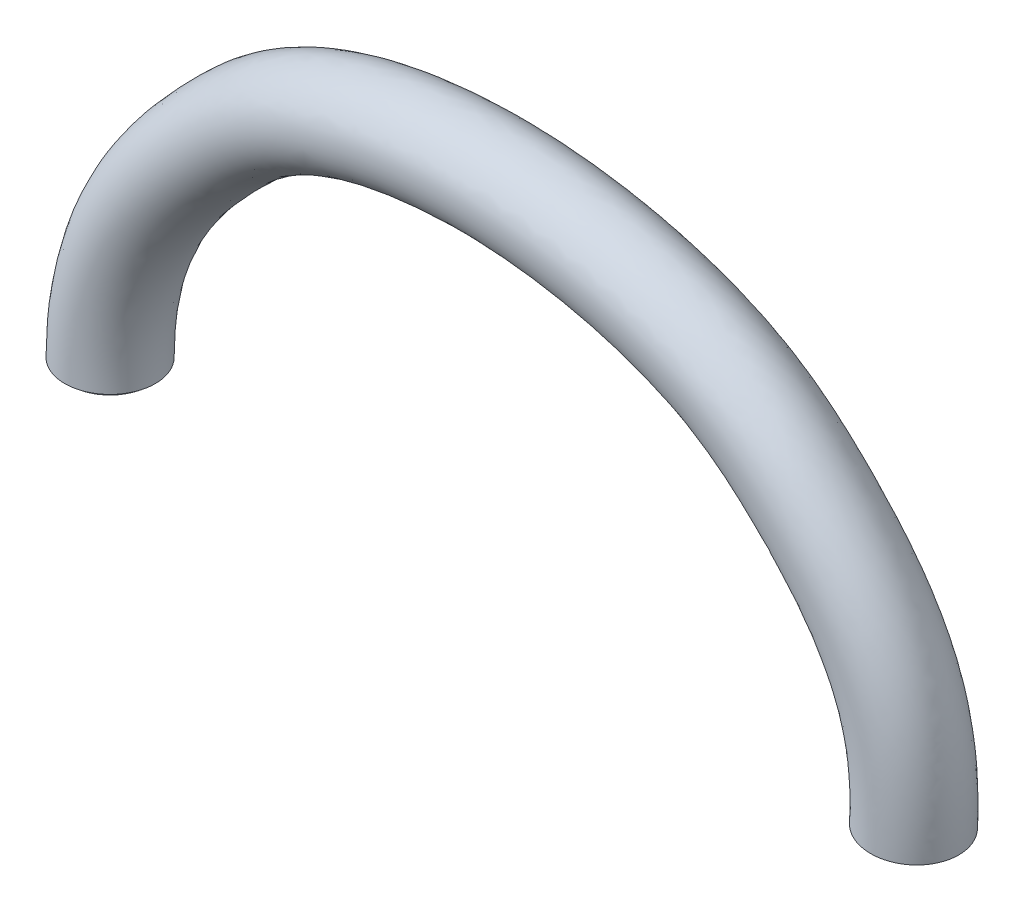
ISO-10303-21;
HEADER;
FILE_DESCRIPTION(('STEP AP214'),'2;1');
FILE_NAME('part.step','',(''),(''),'','','');
FILE_SCHEMA(('AUTOMOTIVE_DESIGN { 1 0 10303 214 1 1 1 1 }'));
ENDSEC;
DATA;
#1=APPLICATION_CONTEXT('core data for automotive mechanical design processes');
#2=APPLICATION_PROTOCOL_DEFINITION('international standard','automotive_design',2000,#1);
#3=PRODUCT_CONTEXT('',#1,'mechanical');
#4=PRODUCT('Part','Part','',(#3));
#5=PRODUCT_RELATED_PRODUCT_CATEGORY('part','',(#4));
#6=PRODUCT_DEFINITION_FORMATION('','',#4);
#7=PRODUCT_DEFINITION_CONTEXT('part definition',#1,'design');
#8=PRODUCT_DEFINITION('design','',#6,#7);
#9=PRODUCT_DEFINITION_SHAPE('','',#8);
#10=(LENGTH_UNIT() NAMED_UNIT(*) SI_UNIT(.MILLI.,.METRE.));
#11=(NAMED_UNIT(*) PLANE_ANGLE_UNIT() SI_UNIT($,.RADIAN.));
#12=(NAMED_UNIT(*) SI_UNIT($,.STERADIAN.) SOLID_ANGLE_UNIT());
#13=UNCERTAINTY_MEASURE_WITH_UNIT(LENGTH_MEASURE(1.E-05),#10,'distance_accuracy_value','');
#14=(GEOMETRIC_REPRESENTATION_CONTEXT(3) GLOBAL_UNCERTAINTY_ASSIGNED_CONTEXT((#13)) GLOBAL_UNIT_ASSIGNED_CONTEXT((#10,
#11,#12)) REPRESENTATION_CONTEXT('',''));
#15=CARTESIAN_POINT('',(0.,0.,0.));
#16=DIRECTION('',(0.,0.,1.));
#17=DIRECTION('',(1.,0.,0.));
#18=AXIS2_PLACEMENT_3D('',#15,#16,#17);
#19=CARTESIAN_POINT('',(0.,0.,0.));
#20=DIRECTION('',(0.,1.,0.));
#21=DIRECTION('',(0.,0.,1.));
#22=AXIS2_PLACEMENT_3D('',#19,#20,#21);
#23=PLANE('',#22);
#24=CARTESIAN_POINT('',(0.,0.,0.));
#25=DIRECTION('',(0.,-1.,0.));
#26=DIRECTION('',(0.,0.,-1.));
#27=AXIS2_PLACEMENT_3D('',#24,#25,#26);
#28=CIRCLE('',#27,20.054815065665);
#29=CARTESIAN_POINT('',(0.,0.,-20.054815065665));
#30=VERTEX_POINT('',#29);
#31=EDGE_CURVE('E17',#30,#30,#28,.F.);
#32=ORIENTED_EDGE('',*,*,#31,.F.);
#33=EDGE_LOOP('',(#32));
#34=FACE_BOUND('',#33,.T.);
#35=ADVANCED_FACE('F14',(#34),#23,.F.);
#36=CARTESIAN_POINT('',(0.,2.,0.));
#37=DIRECTION('',(0.,-1.,0.));
#38=DIRECTION('',(0.,0.,-1.));
#39=AXIS2_PLACEMENT_3D('',#36,#37,#38);
#40=CYLINDRICAL_SURFACE('',#39,20.054815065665);
#41=CARTESIAN_POINT('',(0.,2.,0.));
#42=DIRECTION('',(0.,-1.,0.));
#43=DIRECTION('',(0.,0.,-1.));
#44=AXIS2_PLACEMENT_3D('',#41,#42,#43);
#45=CIRCLE('',#44,20.054815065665);
#46=CARTESIAN_POINT('',(0.,2.,-20.054815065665));
#47=VERTEX_POINT('',#46);
#48=EDGE_CURVE('E30',#47,#47,#45,.F.);
#49=ORIENTED_EDGE('',*,*,#48,.F.);
#50=EDGE_LOOP('',(#49));
#51=FACE_BOUND('',#50,.T.);
#52=ORIENTED_EDGE('',*,*,#31,.T.);
#53=EDGE_LOOP('',(#52));
#54=FACE_BOUND('',#53,.T.);
#55=ADVANCED_FACE('F50',(#51,#54),#40,.T.);
#56=CARTESIAN_POINT('',(0.,2.,0.));
#57=DIRECTION('',(0.,-1.,0.));
#58=DIRECTION('',(0.,0.,-1.));
#59=AXIS2_PLACEMENT_3D('',#56,#57,#58);
#60=PLANE('',#59);
#61=ORIENTED_EDGE('',*,*,#48,.T.);
#62=EDGE_LOOP('',(#61));
#63=FACE_BOUND('',#62,.T.);
#64=CARTESIAN_POINT('',(-0.00541417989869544,2.,-22.5));
#65=CARTESIAN_POINT('',(-0.637067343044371,2.,-22.4999946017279));
#66=CARTESIAN_POINT('',(-1.26888605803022,2.,-22.4733678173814));
#67=CARTESIAN_POINT('',(-2.21314761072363,2.,-22.3936500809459));
#68=CARTESIAN_POINT('',(-2.52741685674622,2.,-22.3604320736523));
#69=CARTESIAN_POINT('',(-3.15435972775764,2.,-22.2807839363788));
#70=CARTESIAN_POINT('',(-3.46703295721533,2.,-22.2343506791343));
#71=CARTESIAN_POINT('',(-4.40277156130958,2.,-22.0751600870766));
#72=CARTESIAN_POINT('',(-5.02257303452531,2.,-21.9425949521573));
#73=CARTESIAN_POINT('',(-6.24878827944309,2.,-21.625649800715));
#74=CARTESIAN_POINT('',(-6.85520196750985,2.,-21.4412694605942));
#75=CARTESIAN_POINT('',(-7.75119715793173,2.,-21.1269751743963));
#76=CARTESIAN_POINT('',(-8.04751856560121,2.,-21.0159557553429));
#77=CARTESIAN_POINT('',(-8.63514023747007,2.,-20.7815543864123));
#78=CARTESIAN_POINT('',(-8.92644177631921,2.,-20.6581756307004));
#79=CARTESIAN_POINT('',(-9.79221895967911,2.,-20.2697375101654));
#80=CARTESIAN_POINT('',(-10.3586050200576,2.,-19.9863630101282));
#81=CARTESIAN_POINT('',(-11.4651413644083,2.,-19.3730818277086));
#82=CARTESIAN_POINT('',(-12.0053042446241,2.,-19.0431977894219));
#83=CARTESIAN_POINT('',(-13.0559440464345,2.,-18.3391020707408));
#84=CARTESIAN_POINT('',(-13.5664211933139,2.,-17.9648907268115));
#85=CARTESIAN_POINT('',(-14.5541469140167,2.,-17.1747231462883));
#86=CARTESIAN_POINT('',(-15.0313883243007,2.,-16.7587579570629));
#87=CARTESIAN_POINT('',(-15.9491377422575,2.,-15.888103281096));
#88=CARTESIAN_POINT('',(-16.3896456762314,2.,-15.4334137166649));
#89=CARTESIAN_POINT('',(-17.2308302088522,2.,-14.4885036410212));
#90=CARTESIAN_POINT('',(-17.6315033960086,2.,-13.9982800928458));
#91=CARTESIAN_POINT('',(-18.3901276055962,2.,-12.9858219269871));
#92=CARTESIAN_POINT('',(-18.7480786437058,2.,-12.4635873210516));
#93=CARTESIAN_POINT('',(-19.4187111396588,2.,-11.3908245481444));
#94=CARTESIAN_POINT('',(-19.7313929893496,2.,-10.840296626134));
#95=CARTESIAN_POINT('',(-20.3092681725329,2.,-9.71485699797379));
#96=CARTESIAN_POINT('',(-20.5744615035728,2.,-9.13994529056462));
#97=CARTESIAN_POINT('',(-21.0554719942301,2.,-7.96983158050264));
#98=CARTESIAN_POINT('',(-21.2712896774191,2.,-7.37462979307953));
#99=CARTESIAN_POINT('',(-21.6520184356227,2.,-6.16816147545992));
#100=CARTESIAN_POINT('',(-21.8169295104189,2.,-5.55689494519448));
#101=CARTESIAN_POINT('',(-22.0946768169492,2.,-4.32262506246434));
#102=CARTESIAN_POINT('',(-22.2075115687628,2.,-3.69962137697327));
#103=CARTESIAN_POINT('',(-22.3802972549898,2.,-2.44632318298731));
#104=CARTESIAN_POINT('',(-22.4402481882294,2.,-1.81602867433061));
#105=CARTESIAN_POINT('',(-22.5068400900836,2.,-0.552629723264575));
#106=CARTESIAN_POINT('',(-22.5134810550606,2.,0.0804747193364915));
#107=CARTESIAN_POINT('',(-22.4734058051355,2.,1.3449925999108));
#108=CARTESIAN_POINT('',(-22.42668959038,2.,1.9764060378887));
#109=CARTESIAN_POINT('',(-22.2802316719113,2.,3.23305629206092));
#110=CARTESIAN_POINT('',(-22.1804896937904,2.,3.85829307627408));
#111=CARTESIAN_POINT('',(-21.9286890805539,2.,5.09814167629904));
#112=CARTESIAN_POINT('',(-21.7766304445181,2.,5.71275349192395));
#113=CARTESIAN_POINT('',(-21.421275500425,2.,6.92698912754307));
#114=CARTESIAN_POINT('',(-21.2179786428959,2.,7.5266127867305));
#115=CARTESIAN_POINT('',(-20.7615932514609,2.,8.7066021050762));
#116=CARTESIAN_POINT('',(-20.508504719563,2.,9.28696776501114));
#117=CARTESIAN_POINT('',(-19.9543259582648,2.,10.4243335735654));
#118=CARTESIAN_POINT('',(-19.6532341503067,2.,10.9813329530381));
#119=CARTESIAN_POINT('',(-19.0051953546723,2.,12.0679855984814));
#120=CARTESIAN_POINT('',(-18.6582483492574,2.,12.5976388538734));
#121=CARTESIAN_POINT('',(-17.9209969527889,2.,13.6257891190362));
#122=CARTESIAN_POINT('',(-17.530696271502,2.,14.1242887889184));
#123=CARTESIAN_POINT('',(-16.709490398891,2.,15.0866352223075));
#124=CARTESIAN_POINT('',(-16.2785852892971,2.,15.5504820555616));
#125=CARTESIAN_POINT('',(-15.3793233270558,2.,16.4401336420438));
#126=CARTESIAN_POINT('',(-14.910974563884,2.,16.8659465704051));
#127=CARTESIAN_POINT('',(-13.9400937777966,2.,17.6766063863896));
#128=CARTESIAN_POINT('',(-13.4375614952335,2.,18.0614529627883));
#129=CARTESIAN_POINT('',(-12.4015429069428,2.,18.7876664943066));
#130=CARTESIAN_POINT('',(-11.8680416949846,2.,19.1290122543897));
#131=CARTESIAN_POINT('',(-11.0478307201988,2.,19.6063085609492));
#132=CARTESIAN_POINT('',(-10.7710914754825,2.,19.7596245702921));
#133=CARTESIAN_POINT('',(-10.2113230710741,2.,20.0544949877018));
#134=CARTESIAN_POINT('',(-9.92829230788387,2.,20.1960463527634));
#135=CARTESIAN_POINT('',(-9.07025167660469,2.,20.6027695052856));
#136=CARTESIAN_POINT('',(-8.48655347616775,2.,20.8498590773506));
#137=CARTESIAN_POINT('',(-7.30039758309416,2.,21.293913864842));
#138=CARTESIAN_POINT('',(-6.69794000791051,2.,21.4908793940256));
#139=CARTESIAN_POINT('',(-5.78408307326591,2.,21.747522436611));
#140=CARTESIAN_POINT('',(-5.47801119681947,2.,21.8265561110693));
#141=CARTESIAN_POINT('',(-4.86289075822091,2.,21.9716453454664));
#142=CARTESIAN_POINT('',(-4.55384291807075,2.,22.0377039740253));
#143=CARTESIAN_POINT('',(-3.62315861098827,2.,22.216205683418));
#144=CARTESIAN_POINT('',(-2.99761744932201,2.,22.3090767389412));
#145=CARTESIAN_POINT('',(-1.97685273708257,2.,22.4169394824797));
#146=CARTESIAN_POINT('',(-1.58323360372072,2.,22.4480761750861));
#147=CARTESIAN_POINT('',(-0.794902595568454,2.,22.4896081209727));
#148=CARTESIAN_POINT('',(-0.40019072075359,2.,22.5000033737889));
#149=CARTESIAN_POINT('',(0.626231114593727,2.,22.4999946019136));
#150=CARTESIAN_POINT('',(1.25804195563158,2.,22.4733684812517));
#151=CARTESIAN_POINT('',(2.20229180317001,2.,22.3936525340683));
#152=CARTESIAN_POINT('',(2.51655716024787,2.,22.3604352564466));
#153=CARTESIAN_POINT('',(3.14349229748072,2.,22.2807888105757));
#154=CARTESIAN_POINT('',(3.45616168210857,2.,22.2343565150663));
#155=CARTESIAN_POINT('',(4.39188875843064,2.,22.0751691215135));
#156=CARTESIAN_POINT('',(5.0116826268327,2.,21.9426065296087));
#157=CARTESIAN_POINT('',(6.23788288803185,2.,21.625667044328));
#158=CARTESIAN_POINT('',(6.84428919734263,2.,21.4412898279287));
#159=CARTESIAN_POINT('',(7.74027363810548,2.,21.1270004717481));
#160=CARTESIAN_POINT('',(8.03659159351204,2.,21.015982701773));
#161=CARTESIAN_POINT('',(8.62420640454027,2.,20.7815847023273));
#162=CARTESIAN_POINT('',(8.91550453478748,2.,20.6582076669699));
#163=CARTESIAN_POINT('',(9.78127154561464,2.,20.2697747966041));
#164=CARTESIAN_POINT('',(10.3476508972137,2.,19.9864039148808));
#165=CARTESIAN_POINT('',(11.454173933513,2.,19.3731301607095));
#166=CARTESIAN_POINT('',(11.9943302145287,2.,19.0432499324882));
#167=CARTESIAN_POINT('',(13.0449569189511,2.,18.3391620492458));
#168=CARTESIAN_POINT('',(13.5554275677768,2.,17.9649547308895));
#169=CARTESIAN_POINT('',(14.5431368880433,2.,17.1747983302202));
#170=CARTESIAN_POINT('',(15.020368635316,2.,16.7588405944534));
#171=CARTESIAN_POINT('',(15.9380995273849,2.,15.8882017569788));
#172=CARTESIAN_POINT('',(16.3785985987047,2.,15.433520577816));
#173=CARTESIAN_POINT('',(17.2197664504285,2.,14.4886282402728));
#174=CARTESIAN_POINT('',(17.6204318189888,2.,13.9984140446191));
#175=CARTESIAN_POINT('',(18.3790417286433,2.,12.9859755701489));
#176=CARTESIAN_POINT('',(18.7369862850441,2.,12.4637513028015));
#177=CARTESIAN_POINT('',(19.4076099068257,2.,11.3910062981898));
#178=CARTESIAN_POINT('',(19.7202890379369,2.,10.8404856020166));
#179=CARTESIAN_POINT('',(20.2981601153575,2.,9.71506096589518));
#180=CARTESIAN_POINT('',(20.5633520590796,2.,9.14015702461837));
#181=CARTESIAN_POINT('',(21.0443614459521,2.,7.97005924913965));
#182=CARTESIAN_POINT('',(21.2601794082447,2.,7.37486562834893));
#183=CARTESIAN_POINT('',(21.6409106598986,2.,6.16841392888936));
#184=CARTESIAN_POINT('',(21.8058239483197,2.,5.55715584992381));
#185=CARTESIAN_POINT('',(22.0835804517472,2.,4.32289136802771));
#186=CARTESIAN_POINT('',(22.196421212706,2.,3.699884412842));
#187=CARTESIAN_POINT('',(22.3692192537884,2.,2.44657924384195));
#188=CARTESIAN_POINT('',(22.4291765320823,2.,1.81628102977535));
#189=CARTESIAN_POINT('',(22.49578150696,2.,0.552874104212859));
#190=CARTESIAN_POINT('',(22.502429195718,2.,-0.080234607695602));
#191=CARTESIAN_POINT('',(22.4623677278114,2.,-1.34476163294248));
#192=CARTESIAN_POINT('',(22.4156585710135,2.,-1.97617994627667));
#193=CARTESIAN_POINT('',(22.2692140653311,2.,-3.232848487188));
#194=CARTESIAN_POINT('',(22.1694777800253,2.,-3.85809860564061));
#195=CARTESIAN_POINT('',(21.9176872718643,2.,-5.09797428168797));
#196=CARTESIAN_POINT('',(21.7656330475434,2.,-5.71259983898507));
#197=CARTESIAN_POINT('',(21.4102854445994,2.,-6.9268631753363));
#198=CARTESIAN_POINT('',(21.2069915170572,2.,-7.52650079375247));
#199=CARTESIAN_POINT('',(20.7506102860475,2.,-8.70651800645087));
#200=CARTESIAN_POINT('',(20.4975229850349,2.,-9.28689760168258));
#201=CARTESIAN_POINT('',(19.9433464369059,2.,-10.4242875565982));
#202=CARTESIAN_POINT('',(19.6422558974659,2.,-10.981297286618));
#203=CARTESIAN_POINT('',(18.9942181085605,2.,-12.0679702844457));
#204=CARTESIAN_POINT('',(18.6472708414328,2.,-12.5976335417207));
#205=CARTESIAN_POINT('',(17.9100172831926,2.,-13.6258030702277));
#206=CARTESIAN_POINT('',(17.5197147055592,2.,-14.1243120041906));
#207=CARTESIAN_POINT('',(16.6985033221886,2.,-15.0866758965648));
#208=CARTESIAN_POINT('',(16.2675945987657,2.,-15.550530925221));
#209=CARTESIAN_POINT('',(15.3683320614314,2.,-16.4401892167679));
#210=CARTESIAN_POINT('',(14.8999870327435,2.,-16.8660013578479));
#211=CARTESIAN_POINT('',(13.9291133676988,2.,-17.6766593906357));
#212=CARTESIAN_POINT('',(13.4265844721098,2.,-18.0615049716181));
#213=CARTESIAN_POINT('',(12.3905723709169,2.,-18.7877161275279));
#214=CARTESIAN_POINT('',(11.8570742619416,2.,-19.1290605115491));
#215=CARTESIAN_POINT('',(11.0368677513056,2.,-19.6063544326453));
#216=CARTESIAN_POINT('',(10.7601299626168,2.,-19.7596695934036));
#217=CARTESIAN_POINT('',(10.200364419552,2.,-20.0545382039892));
#218=CARTESIAN_POINT('',(9.91733506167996,2.,-20.1960886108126));
#219=CARTESIAN_POINT('',(9.05930621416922,2.,-20.6028051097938));
#220=CARTESIAN_POINT('',(8.47561864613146,2.,-20.8498894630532));
#221=CARTESIAN_POINT('',(7.28948444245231,2.,-21.293934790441));
#222=CARTESIAN_POINT('',(6.68703792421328,2.,-21.4908960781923));
#223=CARTESIAN_POINT('',(5.77319781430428,2.,-21.7475336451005));
#224=CARTESIAN_POINT('',(5.46713156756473,2.,-21.8265656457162));
#225=CARTESIAN_POINT('',(4.85202246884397,2.,-21.9716518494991));
#226=CARTESIAN_POINT('',(4.54298033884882,2.,-22.0377091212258));
#227=CARTESIAN_POINT('',(3.61231325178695,2.,-22.2162072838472));
#228=CARTESIAN_POINT('',(2.98678371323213,2.,-22.3090766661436));
#229=CARTESIAN_POINT('',(1.966029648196,2.,-22.416938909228));
#230=CARTESIAN_POINT('',(1.5724094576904,2.,-22.4480758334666));
#231=CARTESIAN_POINT('',(0.784076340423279,2.,-22.4896080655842));
#232=CARTESIAN_POINT('',(0.389363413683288,2.,-22.5000033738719));
#233=CARTESIAN_POINT('',(-0.00541417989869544,2.,-22.5));
#234=B_SPLINE_CURVE_WITH_KNOTS('',3,(#64,#65,#66,#67,#68,#69,#70,#71,#72,#73,#74,#75,#76,#77,
#78,#79,#80,#81,#82,#83,#84,#85,#86,#87,#88,#89,#90,#91,#92,#93,#94,#95,#96,#97,#98,#99,#100,
#101,#102,#103,#104,#105,#106,#107,#108,#109,#110,#111,#112,#113,#114,#115,#116,#117,#118,#119,
#120,#121,#122,#123,#124,#125,#126,#127,#128,#129,#130,#131,#132,#133,#134,#135,#136,#137,#138,
#139,#140,#141,#142,#143,#144,#145,#146,#147,#148,#149,#150,#151,#152,#153,#154,#155,#156,#157,
#158,#159,#160,#161,#162,#163,#164,#165,#166,#167,#168,#169,#170,#171,#172,#173,#174,#175,#176,
#177,#178,#179,#180,#181,#182,#183,#184,#185,#186,#187,#188,#189,#190,#191,#192,#193,#194,#195,
#196,#197,#198,#199,#200,#201,#202,#203,#204,#205,#206,#207,#208,#209,#210,#211,#212,#213,#214,
#215,#216,#217,#218,#219,#220,#221,#222,#223,#224,#225,#226,#227,#228,#229,#230,#231,#232,#233),
.UNSPECIFIED.,.T.,.F.,(4,2,2,2,2,2,2,2,2,2,2,2,2,2,2,2,2,2,2,2,2,2,2,2,2,2,2,2,2,2,2,2,2,2,2,2,
2,2,2,2,2,2,2,2,2,2,2,2,2,2,2,2,2,2,2,2,2,2,2,2,2,2,2,2,2,2,2,2,2,2,2,2,2,2,2,2,2,2,2,2,2,2,2,2,
4),(0.,1.89453439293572,2.8423667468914,3.79042358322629,5.68948656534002,7.58856140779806,
8.53762188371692,9.48643771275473,11.3839494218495,13.2805404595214,15.1771171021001,
17.0741012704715,18.971089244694,20.8682395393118,22.7653891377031,24.662522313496,
26.5596555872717,28.4567687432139,30.3538819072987,32.251048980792,34.148216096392,
36.0453833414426,37.9425505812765,39.8397276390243,41.7369047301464,43.6341021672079,
45.5312995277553,47.4285592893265,49.3258197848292,51.2229180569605,53.1200125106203,
55.0166982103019,56.9133983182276,58.8110190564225,59.7598893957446,60.7090044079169,
62.6081339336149,64.5072515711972,65.4553355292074,66.4031949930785,68.2977835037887,
69.4818474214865,70.6659113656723,72.5604221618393,73.5082426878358,74.4562876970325,
76.3553268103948,78.2543777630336,79.2034268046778,80.1522312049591,82.0497200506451,
83.946288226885,85.8428419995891,87.7397896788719,89.6367411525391,91.5338549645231,
93.4309680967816,95.3280784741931,97.2251889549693,99.1222794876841,101.019370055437,
102.916550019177,104.813730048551,106.710910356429,108.608090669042,110.505304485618,
112.402518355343,114.299752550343,116.196986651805,118.094271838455,119.99155775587,
121.888681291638,123.785800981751,125.682476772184,127.579166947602,129.476777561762,
130.425642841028,131.374752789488,133.273846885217,135.172929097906,136.120995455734,
137.068837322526,138.963390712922,140.147457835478,141.331524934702),.UNSPECIFIED.);
#235=CARTESIAN_POINT('',(-0.00541417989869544,2.,-22.5));
#236=VERTEX_POINT('',#235);
#237=EDGE_CURVE('E22',#236,#236,#234,.T.);
#238=ORIENTED_EDGE('',*,*,#237,.F.);
#239=EDGE_LOOP('',(#238));
#240=FACE_BOUND('',#239,.T.);
#241=ADVANCED_FACE('F46',(#63,#240),#60,.T.);
#242=CARTESIAN_POINT('',(399.1,0.,0.));
#243=DIRECTION('',(-0.0562123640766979,-0.998418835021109,0.));
#244=DIRECTION('',(0.998418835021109,-0.0562123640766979,0.));
#245=AXIS2_PLACEMENT_3D('',#242,#243,#244);
#246=PLANE('',#245);
#247=CARTESIAN_POINT('',(399.1,0.,22.5));
#248=CARTESIAN_POINT('',(399.730688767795,-0.0355086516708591,22.4999946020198));
#249=CARTESIAN_POINT('',(400.361542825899,-0.0710266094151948,22.4733667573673));
#250=CARTESIAN_POINT('',(401.304362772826,-0.124108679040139,22.393645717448));
#251=CARTESIAN_POINT('',(401.618152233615,-0.141775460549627,22.3604263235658));
#252=CARTESIAN_POINT('',(402.244138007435,-0.177019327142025,22.2807748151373));
#253=CARTESIAN_POINT('',(402.556333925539,-0.194596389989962,22.2343395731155));
#254=CARTESIAN_POINT('',(403.49064411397,-0.247199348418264,22.0751420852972));
#255=CARTESIAN_POINT('',(404.109499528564,-0.282041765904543,21.9425710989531));
#256=CARTESIAN_POINT('',(405.333843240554,-0.350974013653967,21.6256114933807));
#257=CARTESIAN_POINT('',(405.939331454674,-0.385063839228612,21.441222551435));
#258=CARTESIAN_POINT('',(406.833959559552,-0.435432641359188,21.1269130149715));
#259=CARTESIAN_POINT('',(407.129829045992,-0.452090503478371,21.0158880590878));
#260=CARTESIAN_POINT('',(407.716554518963,-0.485123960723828,20.7814748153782));
#261=CARTESIAN_POINT('',(408.007411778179,-0.501499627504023,20.6580897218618));
#262=CARTESIAN_POINT('',(408.871868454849,-0.550169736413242,20.2696313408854));
#263=CARTESIAN_POINT('',(409.437390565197,-0.582009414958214,19.9862416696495));
#264=CARTESIAN_POINT('',(410.542238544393,-0.64421388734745,19.3729266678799));
#265=CARTESIAN_POINT('',(411.081576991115,-0.674579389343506,19.0430239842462));
#266=CARTESIAN_POINT('',(412.130612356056,-0.733641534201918,18.3388873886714));
#267=CARTESIAN_POINT('',(412.640309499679,-0.762338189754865,17.9646538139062));
#268=CARTESIAN_POINT('',(413.626515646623,-0.817862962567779,17.1744453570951));
#269=CARTESIAN_POINT('',(414.1030181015,-0.844690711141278,16.758462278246));
#270=CARTESIAN_POINT('',(415.019345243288,-0.896281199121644,15.8877696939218));
#271=CARTESIAN_POINT('',(415.459169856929,-0.921043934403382,15.4330601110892));
#272=CARTESIAN_POINT('',(416.299047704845,-0.968330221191,14.4881079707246));
#273=CARTESIAN_POINT('',(416.699097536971,-0.990853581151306,13.9978623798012));
#274=CARTESIAN_POINT('',(417.456539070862,-1.03349858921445,12.9853582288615));
#275=CARTESIAN_POINT('',(417.813930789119,-1.05362023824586,12.4630996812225));
#276=CARTESIAN_POINT('',(418.483502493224,-1.09131805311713,11.3903029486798));
#277=CARTESIAN_POINT('',(418.795684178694,-1.10889431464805,10.8397658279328));
#278=CARTESIAN_POINT('',(419.372632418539,-1.14137730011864,9.71430788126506));
#279=CARTESIAN_POINT('',(419.63739897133,-1.15628402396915,9.13938705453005));
#280=CARTESIAN_POINT('',(420.117631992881,-1.18332180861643,7.9692553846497));
#281=CARTESIAN_POINT('',(420.333098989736,-1.19545289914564,7.37404475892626));
#282=CARTESIAN_POINT('',(420.713204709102,-1.21685337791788,6.16755919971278));
#283=CARTESIAN_POINT('',(420.877843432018,-1.22612276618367,5.55628426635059));
#284=CARTESIAN_POINT('',(421.155122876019,-1.24173398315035,4.32201253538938));
#285=CARTESIAN_POINT('',(421.267763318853,-1.24807579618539,3.69901567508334));
#286=CARTESIAN_POINT('',(421.440244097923,-1.25778670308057,2.44573240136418));
#287=CARTESIAN_POINT('',(421.500084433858,-1.26115579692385,1.81544598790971));
#288=CARTESIAN_POINT('',(421.566539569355,-1.26489731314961,0.552064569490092));
#289=CARTESIAN_POINT('',(421.573154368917,-1.26526973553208,-0.0810304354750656));
#290=CARTESIAN_POINT('',(421.533111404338,-1.26301526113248,-1.34552810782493));
#291=CARTESIAN_POINT('',(421.486453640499,-1.26038836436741,-1.97693077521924));
#292=CARTESIAN_POINT('',(421.340197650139,-1.25215394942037,-3.23355151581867));
#293=CARTESIAN_POINT('',(421.240599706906,-1.24654644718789,-3.85876962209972));
#294=CARTESIAN_POINT('',(420.989171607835,-1.23239069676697,-5.09857979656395));
#295=CARTESIAN_POINT('',(420.837341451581,-1.22384244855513,-5.71317186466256));
#296=CARTESIAN_POINT('',(420.482526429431,-1.20386587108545,-6.92736713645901));
#297=CARTESIAN_POINT('',(420.279541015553,-1.19243751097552,-7.52697017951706));
#298=CARTESIAN_POINT('',(419.823859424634,-1.16678200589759,-8.70691767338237));
#299=CARTESIAN_POINT('',(419.571163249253,-1.15255486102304,-9.28726212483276));
#300=CARTESIAN_POINT('',(419.017846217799,-1.12140234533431,-10.4245879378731));
#301=CARTESIAN_POINT('',(418.717223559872,-1.10447687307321,-10.9815684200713));
#302=CARTESIAN_POINT('',(418.070197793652,-1.06804842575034,-12.0681831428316));
#303=CARTESIAN_POINT('',(417.72379466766,-1.04854544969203,-12.5978173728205));
#304=CARTESIAN_POINT('',(416.987702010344,-1.00710241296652,-13.625929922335));
#305=CARTESIAN_POINT('',(416.598016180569,-0.985162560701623,-14.1244109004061));
#306=CARTESIAN_POINT('',(415.77810681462,-0.939000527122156,-15.0867207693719));
#307=CARTESIAN_POINT('',(415.347883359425,-0.914778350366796,-15.5505497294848));
#308=CARTESIAN_POINT('',(414.450038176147,-0.864228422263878,-16.4401753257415));
#309=CARTESIAN_POINT('',(413.98242382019,-0.837901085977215,-16.8659794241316));
#310=CARTESIAN_POINT('',(413.013067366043,-0.783324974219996,-17.6766220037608));
#311=CARTESIAN_POINT('',(412.511325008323,-0.755076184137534,-18.061460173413));
#312=CARTESIAN_POINT('',(411.476936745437,-0.696838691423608,-18.7876578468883));
#313=CARTESIAN_POINT('',(410.944275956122,-0.666849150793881,-19.1289961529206));
#314=CARTESIAN_POINT('',(410.125358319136,-0.620742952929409,-19.6062823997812));
#315=CARTESIAN_POINT('',(409.849055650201,-0.605186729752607,-19.7595952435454));
#316=CARTESIAN_POINT('',(409.290170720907,-0.573720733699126,-20.0544597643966));
#317=CARTESIAN_POINT('',(409.00758685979,-0.557810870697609,-20.1960083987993));
#318=CARTESIAN_POINT('',(408.150885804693,-0.509577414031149,-20.6027316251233));
#319=CARTESIAN_POINT('',(407.568093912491,-0.47676542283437,-20.8498234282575));
#320=CARTESIAN_POINT('',(406.383780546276,-0.410086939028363,-21.2938824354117));
#321=CARTESIAN_POINT('',(405.782259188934,-0.37622045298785,-21.4908499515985));
#322=CARTESIAN_POINT('',(404.869822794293,-0.324849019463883,-21.7474960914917));
#323=CARTESIAN_POINT('',(404.564226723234,-0.307643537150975,-21.8265308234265));
#324=CARTESIAN_POINT('',(403.950062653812,-0.273065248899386,-21.9716222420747));
#325=CARTESIAN_POINT('',(403.641495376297,-0.255692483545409,-22.0376819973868));
#326=CARTESIAN_POINT('',(402.712258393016,-0.203375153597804,-22.216187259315));
#327=CARTESIAN_POINT('',(402.087690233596,-0.168211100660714,-22.3090609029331));
#328=CARTESIAN_POINT('',(401.068489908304,-0.110828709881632,-22.4169309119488));
#329=CARTESIAN_POINT('',(400.675459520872,-0.0887005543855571,-22.4480708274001));
#330=CARTESIAN_POINT('',(399.888307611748,-0.0443828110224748,-22.4896070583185));
#331=CARTESIAN_POINT('',(399.494186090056,-0.0221932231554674,-22.5000033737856));
#332=CARTESIAN_POINT('',(398.469311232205,0.0355086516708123,-22.4999946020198));
#333=CARTESIAN_POINT('',(397.838457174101,0.0710266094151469,-22.4733667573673));
#334=CARTESIAN_POINT('',(396.895637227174,0.124108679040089,-22.393645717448));
#335=CARTESIAN_POINT('',(396.581847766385,0.141775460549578,-22.3604263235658));
#336=CARTESIAN_POINT('',(395.955861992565,0.177019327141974,-22.2807748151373));
#337=CARTESIAN_POINT('',(395.643666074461,0.194596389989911,-22.2343395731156));
#338=CARTESIAN_POINT('',(394.70935588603,0.247199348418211,-22.0751420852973));
#339=CARTESIAN_POINT('',(394.090500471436,0.282041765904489,-21.9425710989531));
#340=CARTESIAN_POINT('',(392.866156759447,0.350974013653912,-21.6256114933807));
#341=CARTESIAN_POINT('',(392.260668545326,0.385063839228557,-21.441222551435));
#342=CARTESIAN_POINT('',(391.366040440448,0.435432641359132,-21.1269130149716));
#343=CARTESIAN_POINT('',(391.070170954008,0.452090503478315,-21.0158880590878));
#344=CARTESIAN_POINT('',(390.483445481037,0.485123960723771,-20.7814748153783));
#345=CARTESIAN_POINT('',(390.192588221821,0.501499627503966,-20.6580897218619));
#346=CARTESIAN_POINT('',(389.328131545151,0.550169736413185,-20.2696313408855));
#347=CARTESIAN_POINT('',(388.762609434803,0.582009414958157,-19.9862416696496));
#348=CARTESIAN_POINT('',(387.657761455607,0.644213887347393,-19.3729266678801));
#349=CARTESIAN_POINT('',(387.118423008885,0.674579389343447,-19.0430239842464));
#350=CARTESIAN_POINT('',(386.069387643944,0.733641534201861,-18.3388873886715));
#351=CARTESIAN_POINT('',(385.559690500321,0.76233818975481,-17.9646538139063));
#352=CARTESIAN_POINT('',(384.573484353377,0.817862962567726,-17.1744453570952));
#353=CARTESIAN_POINT('',(384.0969818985,0.844690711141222,-16.7584622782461));
#354=CARTESIAN_POINT('',(383.180654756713,0.896281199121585,-15.8877696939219));
#355=CARTESIAN_POINT('',(382.740830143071,0.921043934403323,-15.4330601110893));
#356=CARTESIAN_POINT('',(381.900952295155,0.968330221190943,-14.4881079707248));
#357=CARTESIAN_POINT('',(381.500902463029,0.990853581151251,-13.9978623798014));
#358=CARTESIAN_POINT('',(380.743460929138,1.03349858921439,-12.9853582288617));
#359=CARTESIAN_POINT('',(380.386069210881,1.05362023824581,-12.4630996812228));
#360=CARTESIAN_POINT('',(379.716497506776,1.09131805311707,-11.39030294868));
#361=CARTESIAN_POINT('',(379.404315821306,1.10889431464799,-10.839765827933));
#362=CARTESIAN_POINT('',(378.827367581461,1.14137730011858,-9.71430788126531));
#363=CARTESIAN_POINT('',(378.56260102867,1.1562840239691,-9.13938705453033));
#364=CARTESIAN_POINT('',(378.082368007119,1.18332180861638,-7.96925538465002));
#365=CARTESIAN_POINT('',(377.866901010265,1.19545289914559,-7.37404475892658));
#366=CARTESIAN_POINT('',(377.486795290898,1.21685337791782,-6.16755919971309));
#367=CARTESIAN_POINT('',(377.322156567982,1.22612276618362,-5.5562842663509));
#368=CARTESIAN_POINT('',(377.044877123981,1.2417339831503,-4.32201253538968));
#369=CARTESIAN_POINT('',(376.932236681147,1.24807579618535,-3.69901567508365));
#370=CARTESIAN_POINT('',(376.759755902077,1.25778670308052,-2.44573240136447));
#371=CARTESIAN_POINT('',(376.699915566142,1.26115579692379,-1.81544598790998));
#372=CARTESIAN_POINT('',(376.633460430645,1.26489731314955,-0.552064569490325));
#373=CARTESIAN_POINT('',(376.626845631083,1.26526973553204,0.0810304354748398));
#374=CARTESIAN_POINT('',(376.666888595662,1.26301526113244,1.34552810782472));
#375=CARTESIAN_POINT('',(376.713546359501,1.26038836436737,1.97693077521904));
#376=CARTESIAN_POINT('',(376.859802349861,1.25215394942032,3.23355151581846));
#377=CARTESIAN_POINT('',(376.959400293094,1.24654644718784,3.8587696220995));
#378=CARTESIAN_POINT('',(377.210828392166,1.23239069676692,5.09857979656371));
#379=CARTESIAN_POINT('',(377.362658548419,1.22384244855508,5.71317186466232));
#380=CARTESIAN_POINT('',(377.717473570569,1.20386587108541,6.92736713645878));
#381=CARTESIAN_POINT('',(377.920458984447,1.19243751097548,7.52697017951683));
#382=CARTESIAN_POINT('',(378.376140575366,1.16678200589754,8.70691767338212));
#383=CARTESIAN_POINT('',(378.628836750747,1.152554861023,9.2872621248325));
#384=CARTESIAN_POINT('',(379.182153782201,1.12140234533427,10.4245879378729));
#385=CARTESIAN_POINT('',(379.482776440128,1.10447687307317,10.9815684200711));
#386=CARTESIAN_POINT('',(380.129802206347,1.0680484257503,12.0681831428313));
#387=CARTESIAN_POINT('',(380.47620533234,1.04854544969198,12.5978173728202));
#388=CARTESIAN_POINT('',(381.212297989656,1.00710241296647,13.6259299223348));
#389=CARTESIAN_POINT('',(381.601983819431,0.985162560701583,14.124410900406));
#390=CARTESIAN_POINT('',(382.42189318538,0.939000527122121,15.0867207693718));
#391=CARTESIAN_POINT('',(382.852116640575,0.914778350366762,15.5505497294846));
#392=CARTESIAN_POINT('',(383.749961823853,0.864228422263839,16.4401753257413));
#393=CARTESIAN_POINT('',(384.217576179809,0.837901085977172,16.8659794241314));
#394=CARTESIAN_POINT('',(385.186932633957,0.783324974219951,17.6766220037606));
#395=CARTESIAN_POINT('',(385.688674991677,0.755076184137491,18.0614601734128));
#396=CARTESIAN_POINT('',(386.723063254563,0.696838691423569,18.7876578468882));
#397=CARTESIAN_POINT('',(387.255724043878,0.666849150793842,19.1289961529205));
#398=CARTESIAN_POINT('',(388.074641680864,0.62074295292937,19.6062823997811));
#399=CARTESIAN_POINT('',(388.350944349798,0.605186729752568,19.7595952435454));
#400=CARTESIAN_POINT('',(388.909829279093,0.573720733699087,20.0544597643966));
#401=CARTESIAN_POINT('',(389.19241314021,0.557810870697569,20.1960083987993));
#402=CARTESIAN_POINT('',(390.049114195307,0.509577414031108,20.6027316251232));
#403=CARTESIAN_POINT('',(390.631906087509,0.476765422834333,20.8498234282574));
#404=CARTESIAN_POINT('',(391.816219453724,0.41008693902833,21.2938824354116));
#405=CARTESIAN_POINT('',(392.417740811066,0.376220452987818,21.4908499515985));
#406=CARTESIAN_POINT('',(393.330177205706,0.324849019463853,21.7474960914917));
#407=CARTESIAN_POINT('',(393.635773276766,0.307643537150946,21.8265308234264));
#408=CARTESIAN_POINT('',(394.249937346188,0.273065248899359,21.9716222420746));
#409=CARTESIAN_POINT('',(394.558504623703,0.255692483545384,22.0376819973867));
#410=CARTESIAN_POINT('',(395.487741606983,0.203375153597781,22.2161872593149));
#411=CARTESIAN_POINT('',(396.112309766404,0.168211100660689,22.3090609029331));
#412=CARTESIAN_POINT('',(397.131510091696,0.110828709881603,22.4169309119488));
#413=CARTESIAN_POINT('',(397.524540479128,0.0887005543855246,22.4480708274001));
#414=CARTESIAN_POINT('',(398.311692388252,0.0443828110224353,22.4896070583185));
#415=CARTESIAN_POINT('',(398.705813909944,0.0221932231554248,22.5000033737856));
#416=CARTESIAN_POINT('',(399.1,0.,22.5));
#417=B_SPLINE_CURVE_WITH_KNOTS('',3,(#247,#248,#249,#250,#251,#252,#253,#254,#255,#256,#257,
#258,#259,#260,#261,#262,#263,#264,#265,#266,#267,#268,#269,#270,#271,#272,#273,#274,#275,#276,
#277,#278,#279,#280,#281,#282,#283,#284,#285,#286,#287,#288,#289,#290,#291,#292,#293,#294,#295,
#296,#297,#298,#299,#300,#301,#302,#303,#304,#305,#306,#307,#308,#309,#310,#311,#312,#313,#314,
#315,#316,#317,#318,#319,#320,#321,#322,#323,#324,#325,#326,#327,#328,#329,#330,#331,#332,#333,
#334,#335,#336,#337,#338,#339,#340,#341,#342,#343,#344,#345,#346,#347,#348,#349,#350,#351,#352,
#353,#354,#355,#356,#357,#358,#359,#360,#361,#362,#363,#364,#365,#366,#367,#368,#369,#370,#371,
#372,#373,#374,#375,#376,#377,#378,#379,#380,#381,#382,#383,#384,#385,#386,#387,#388,#389,#390,
#391,#392,#393,#394,#395,#396,#397,#398,#399,#400,#401,#402,#403,#404,#405,#406,#407,#408,#409,
#410,#411,#412,#413,#414,#415,#416),.UNSPECIFIED.,.T.,.F.,(4,2,2,2,2,2,2,2,2,2,2,2,2,2,2,2,2,2,
2,2,2,2,2,2,2,2,2,2,2,2,2,2,2,2,2,2,2,2,2,2,2,2,2,2,2,2,2,2,2,2,2,2,2,2,2,2,2,2,2,2,2,2,2,2,2,2,
2,2,2,2,2,2,2,2,2,2,2,2,2,2,2,2,2,2,4),(0.,1.89463759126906,2.84252154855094,3.79063000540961,
5.68979630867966,7.58897444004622,8.53808746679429,9.48695583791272,11.3845726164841,
13.281268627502,15.1779502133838,17.0750049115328,18.9720633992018,20.8692840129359,
22.766503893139,24.6636524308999,26.5608010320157,28.4579293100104,30.3550575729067,
32.2521959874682,34.1493344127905,36.0464728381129,37.9436112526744,39.8407395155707,
41.7378677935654,43.6350163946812,45.5321649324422,47.4293848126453,49.3266054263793,
51.2236639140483,53.1207186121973,55.0174001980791,56.914096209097,58.8117129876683,
59.7605813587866,60.7096943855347,62.6088725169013,64.5080388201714,65.4561472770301,
66.404031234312,68.2986688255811,69.4828341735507,70.6669995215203,72.5616371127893,
73.5095210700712,74.4576295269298,76.3567958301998,78.2559739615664,79.2050869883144,
80.1539553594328,82.0515721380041,83.9482681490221,85.8449497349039,87.7420044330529,
89.6390629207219,91.5362835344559,93.433503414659,95.3306519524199,97.2278005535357,
99.1249288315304,101.022057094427,102.919195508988,104.816333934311,106.713472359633,
108.610610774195,110.507739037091,112.404867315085,114.302015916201,116.199164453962,
118.096384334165,119.993604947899,121.890663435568,123.787718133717,125.684399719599,
127.581095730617,129.478712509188,130.427580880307,131.376693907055,133.275872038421,
135.175038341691,136.12314679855,137.071030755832,138.965668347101,140.149833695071,
141.333999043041),.UNSPECIFIED.);
#418=CARTESIAN_POINT('',(399.1,0.,22.5));
#419=VERTEX_POINT('',#418);
#420=EDGE_CURVE('E10',#419,#419,#417,.T.);
#421=ORIENTED_EDGE('',*,*,#420,.F.);
#422=EDGE_LOOP('',(#421));
#423=FACE_BOUND('',#422,.T.);
#424=ADVANCED_FACE('F43',(#423),#246,.T.);
#425=CARTESIAN_POINT('',(0.,0.,22.5));
#426=CARTESIAN_POINT('',(-0.128487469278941,15.2800386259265,22.5));
#427=CARTESIAN_POINT('',(1.74505533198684,29.1054493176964,22.5));
#428=CARTESIAN_POINT('',(8.18829293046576,54.1077642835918,22.5));
#429=CARTESIAN_POINT('',(12.7579877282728,65.2846685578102,22.5));
#430=CARTESIAN_POINT('',(23.2856207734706,85.2507201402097,22.5));
#431=CARTESIAN_POINT('',(29.2435590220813,94.0398674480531,22.5));
#432=CARTESIAN_POINT('',(41.2397704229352,109.491154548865,22.5));
#433=CARTESIAN_POINT('',(47.2780435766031,116.153294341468,22.5));
#434=CARTESIAN_POINT('',(58.2862102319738,127.779446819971,22.5));
#435=CARTESIAN_POINT('',(63.2195491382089,132.687886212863,22.5));
#436=CARTESIAN_POINT('',(72.7455014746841,141.196387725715,22.5));
#437=CARTESIAN_POINT('',(77.3381149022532,144.796449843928,22.5));
#438=CARTESIAN_POINT('',(89.9281523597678,153.221228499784,22.5));
#439=CARTESIAN_POINT('',(98.3774099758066,157.579431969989,22.5));
#440=CARTESIAN_POINT('',(116.407178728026,164.820078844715,22.5));
#441=CARTESIAN_POINT('',(125.987689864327,167.702522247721,22.5));
#442=CARTESIAN_POINT('',(145.888320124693,172.0882649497,22.5));
#443=CARTESIAN_POINT('',(156.208439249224,173.591564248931,22.5));
#444=CARTESIAN_POINT('',(177.196639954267,175.315634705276,22.5));
#445=CARTESIAN_POINT('',(187.864721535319,175.536405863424,22.5));
#446=CARTESIAN_POINT('',(219.803441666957,174.419851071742,22.5));
#447=CARTESIAN_POINT('',(241.008555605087,171.303656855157,22.5));
#448=CARTESIAN_POINT('',(270.335304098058,163.651324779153,22.5));
#449=CARTESIAN_POINT('',(279.697399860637,160.604207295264,22.5));
#450=CARTESIAN_POINT('',(297.20297171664,153.613908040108,22.5));
#451=CARTESIAN_POINT('',(305.346447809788,149.67072626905,22.5));
#452=CARTESIAN_POINT('',(319.849565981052,141.087634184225,22.5));
#453=CARTESIAN_POINT('',(326.246844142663,136.466409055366,22.5));
#454=CARTESIAN_POINT('',(337.867744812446,126.970693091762,22.5));
#455=CARTESIAN_POINT('',(343.091367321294,122.09620225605,22.5));
#456=CARTESIAN_POINT('',(358.485538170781,106.928099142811,22.5));
#457=CARTESIAN_POINT('',(367.104481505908,97.1226050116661,22.5));
#458=CARTESIAN_POINT('',(377.523829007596,82.8259592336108,22.5));
#459=CARTESIAN_POINT('',(380.578766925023,78.1290098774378,22.5));
#460=CARTESIAN_POINT('',(385.923550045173,68.7869360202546,22.5));
#461=CARTESIAN_POINT('',(388.213395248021,64.1418115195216,22.5));
#462=CARTESIAN_POINT('',(392.099256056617,54.8180137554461,22.5));
#463=CARTESIAN_POINT('',(393.695271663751,50.139340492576,22.5));
#464=CARTESIAN_POINT('',(396.264736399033,40.66307158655,22.5));
#465=CARTESIAN_POINT('',(397.238185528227,35.8654759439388,22.5));
#466=CARTESIAN_POINT('',(398.633780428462,26.0659886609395,22.5));
#467=CARTESIAN_POINT('',(399.055926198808,21.0640970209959,22.5));
#468=CARTESIAN_POINT('',(399.420177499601,10.7706441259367,22.5));
#469=CARTESIAN_POINT('',(399.362283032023,5.47908287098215,22.5));
#470=CARTESIAN_POINT('',(399.1,0.,22.5));
#471=CARTESIAN_POINT('',(45.,0.,22.5));
#472=CARTESIAN_POINT('',(44.8715125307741,11.3736522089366,22.5));
#473=CARTESIAN_POINT('',(46.204961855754,21.1827789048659,22.5));
#474=CARTESIAN_POINT('',(50.6889736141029,38.8387061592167,22.5));
#475=CARTESIAN_POINT('',(53.8603707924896,46.7029371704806,22.5));
#476=CARTESIAN_POINT('',(61.4385468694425,61.1874521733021,22.5));
#477=CARTESIAN_POINT('',(65.8553791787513,67.7915281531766,22.5));
#478=CARTESIAN_POINT('',(75.2508562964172,79.9505599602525,22.5));
#479=CARTESIAN_POINT('',(80.2097618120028,85.476647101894,22.5));
#480=CARTESIAN_POINT('',(90.1695187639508,96.0140186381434,22.5));
#481=CARTESIAN_POINT('',(94.2348141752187,100.035981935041,22.5));
#482=CARTESIAN_POINT('',(101.117621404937,106.223307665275,22.5));
#483=CARTESIAN_POINT('',(103.910031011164,108.411112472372,22.5));
#484=CARTESIAN_POINT('',(111.72012341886,113.695198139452,22.5));
#485=CARTESIAN_POINT('',(117.370459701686,116.69041372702,22.5));
#486=CARTESIAN_POINT('',(130.250580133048,121.913109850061,22.5));
#487=CARTESIAN_POINT('',(137.471688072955,124.136098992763,22.5));
#488=CARTESIAN_POINT('',(153.034193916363,127.603976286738,22.5));
#489=CARTESIAN_POINT('',(161.371774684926,128.850026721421,22.5));
#490=CARTESIAN_POINT('',(178.647024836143,130.300508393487,22.5));
#491=CARTESIAN_POINT('',(187.583844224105,130.506267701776,22.5));
#492=CARTESIAN_POINT('',(214.514280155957,129.606976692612,22.5));
#493=CARTESIAN_POINT('',(232.63347007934,126.953750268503,22.5));
#494=CARTESIAN_POINT('',(256.931870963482,120.658743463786,22.5));
#495=CARTESIAN_POINT('',(264.550075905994,118.180921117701,22.5));
#496=CARTESIAN_POINT('',(278.272615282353,112.738264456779,22.5));
#497=CARTESIAN_POINT('',(284.374544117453,109.768131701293,22.5));
#498=CARTESIAN_POINT('',(294.388199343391,103.893177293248,22.5));
#499=CARTESIAN_POINT('',(298.924356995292,100.66133511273,22.5));
#500=CARTESIAN_POINT('',(307.659007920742,93.5647978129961,22.5));
#501=CARTESIAN_POINT('',(311.84744051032,89.699319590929,22.5));
#502=CARTESIAN_POINT('',(325.298565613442,76.4781982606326,22.5));
#503=CARTESIAN_POINT('',(332.278662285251,68.4637818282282,22.5));
#504=CARTESIAN_POINT('',(340.054261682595,57.8595221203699,22.5));
#505=CARTESIAN_POINT('',(342.203505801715,54.559850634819,22.5));
#506=CARTESIAN_POINT('',(345.807148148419,48.3213494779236,22.5));
#507=CARTESIAN_POINT('',(347.263708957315,45.3831246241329,22.5));
#508=CARTESIAN_POINT('',(349.686820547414,39.6538963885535,22.5));
#509=CARTESIAN_POINT('',(350.655698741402,36.86063361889,22.5));
#510=CARTESIAN_POINT('',(352.245847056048,31.1202064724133,22.5));
#511=CARTESIAN_POINT('',(352.866963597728,28.169536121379,22.5));
#512=CARTESIAN_POINT('',(353.800493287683,21.8222651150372,22.5));
#513=CARTESIAN_POINT('',(354.110759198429,18.424262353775,22.5));
#514=CARTESIAN_POINT('',(354.398058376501,10.9840766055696,22.5));
#515=CARTESIAN_POINT('',(354.373428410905,6.94282100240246,22.5));
#516=CARTESIAN_POINT('',(354.17115242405,2.52955638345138,22.5));
#517=CARTESIAN_POINT('',(45.,0.,-22.5));
#518=CARTESIAN_POINT('',(44.8715125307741,11.3736522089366,-22.5));
#519=CARTESIAN_POINT('',(46.204961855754,21.1827789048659,-22.5));
#520=CARTESIAN_POINT('',(50.6889736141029,38.8387061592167,-22.5));
#521=CARTESIAN_POINT('',(53.8603707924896,46.7029371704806,-22.5));
#522=CARTESIAN_POINT('',(61.4385468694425,61.1874521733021,-22.5));
#523=CARTESIAN_POINT('',(65.8553791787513,67.7915281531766,-22.5));
#524=CARTESIAN_POINT('',(75.2508562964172,79.9505599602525,-22.5));
#525=CARTESIAN_POINT('',(80.2097618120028,85.476647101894,-22.5));
#526=CARTESIAN_POINT('',(90.1695187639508,96.0140186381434,-22.5));
#527=CARTESIAN_POINT('',(94.2348141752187,100.035981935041,-22.5));
#528=CARTESIAN_POINT('',(101.117621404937,106.223307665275,-22.5));
#529=CARTESIAN_POINT('',(103.910031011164,108.411112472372,-22.5));
#530=CARTESIAN_POINT('',(111.72012341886,113.695198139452,-22.5));
#531=CARTESIAN_POINT('',(117.370459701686,116.69041372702,-22.5));
#532=CARTESIAN_POINT('',(130.250580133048,121.913109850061,-22.5));
#533=CARTESIAN_POINT('',(137.471688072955,124.136098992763,-22.5));
#534=CARTESIAN_POINT('',(153.034193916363,127.603976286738,-22.5));
#535=CARTESIAN_POINT('',(161.371774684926,128.850026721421,-22.5));
#536=CARTESIAN_POINT('',(178.647024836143,130.300508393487,-22.5));
#537=CARTESIAN_POINT('',(187.583844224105,130.506267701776,-22.5));
#538=CARTESIAN_POINT('',(214.514280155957,129.606976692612,-22.5));
#539=CARTESIAN_POINT('',(232.63347007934,126.953750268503,-22.5));
#540=CARTESIAN_POINT('',(256.931870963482,120.658743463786,-22.5));
#541=CARTESIAN_POINT('',(264.550075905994,118.180921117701,-22.5));
#542=CARTESIAN_POINT('',(278.272615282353,112.738264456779,-22.5));
#543=CARTESIAN_POINT('',(284.374544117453,109.768131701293,-22.5));
#544=CARTESIAN_POINT('',(294.388199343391,103.893177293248,-22.5));
#545=CARTESIAN_POINT('',(298.924356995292,100.66133511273,-22.5));
#546=CARTESIAN_POINT('',(307.659007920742,93.5647978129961,-22.5));
#547=CARTESIAN_POINT('',(311.84744051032,89.699319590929,-22.5));
#548=CARTESIAN_POINT('',(325.298565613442,76.4781982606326,-22.5));
#549=CARTESIAN_POINT('',(332.278662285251,68.4637818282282,-22.5));
#550=CARTESIAN_POINT('',(340.054261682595,57.8595221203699,-22.5));
#551=CARTESIAN_POINT('',(342.203505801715,54.559850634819,-22.5));
#552=CARTESIAN_POINT('',(345.807148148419,48.3213494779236,-22.5));
#553=CARTESIAN_POINT('',(347.263708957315,45.3831246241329,-22.5));
#554=CARTESIAN_POINT('',(349.686820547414,39.6538963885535,-22.5));
#555=CARTESIAN_POINT('',(350.655698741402,36.86063361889,-22.5));
#556=CARTESIAN_POINT('',(352.245847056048,31.1202064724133,-22.5));
#557=CARTESIAN_POINT('',(352.866963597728,28.169536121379,-22.5));
#558=CARTESIAN_POINT('',(353.800493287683,21.8222651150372,-22.5));
#559=CARTESIAN_POINT('',(354.110759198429,18.424262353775,-22.5));
#560=CARTESIAN_POINT('',(354.398058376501,10.9840766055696,-22.5));
#561=CARTESIAN_POINT('',(354.373428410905,6.94282100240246,-22.5));
#562=CARTESIAN_POINT('',(354.17115242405,2.52955638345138,-22.5));
#563=CARTESIAN_POINT('',(0.,0.,-22.5));
#564=CARTESIAN_POINT('',(-0.128487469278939,15.2800386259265,-22.5));
#565=CARTESIAN_POINT('',(1.74505533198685,29.1054493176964,-22.5));
#566=CARTESIAN_POINT('',(8.18829293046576,54.1077642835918,-22.5));
#567=CARTESIAN_POINT('',(12.7579877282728,65.2846685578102,-22.5));
#568=CARTESIAN_POINT('',(23.2856207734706,85.2507201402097,-22.5));
#569=CARTESIAN_POINT('',(29.2435590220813,94.0398674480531,-22.5));
#570=CARTESIAN_POINT('',(41.2397704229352,109.491154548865,-22.5));
#571=CARTESIAN_POINT('',(47.2780435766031,116.153294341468,-22.5));
#572=CARTESIAN_POINT('',(58.2862102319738,127.779446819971,-22.5));
#573=CARTESIAN_POINT('',(63.2195491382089,132.687886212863,-22.5));
#574=CARTESIAN_POINT('',(72.7455014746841,141.196387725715,-22.5));
#575=CARTESIAN_POINT('',(77.3381149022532,144.796449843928,-22.5));
#576=CARTESIAN_POINT('',(89.9281523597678,153.221228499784,-22.5));
#577=CARTESIAN_POINT('',(98.3774099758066,157.579431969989,-22.5));
#578=CARTESIAN_POINT('',(116.407178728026,164.820078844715,-22.5));
#579=CARTESIAN_POINT('',(125.987689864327,167.702522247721,-22.5));
#580=CARTESIAN_POINT('',(145.888320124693,172.0882649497,-22.5));
#581=CARTESIAN_POINT('',(156.208439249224,173.591564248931,-22.5));
#582=CARTESIAN_POINT('',(177.196639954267,175.315634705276,-22.5));
#583=CARTESIAN_POINT('',(187.864721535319,175.536405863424,-22.5));
#584=CARTESIAN_POINT('',(219.803441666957,174.419851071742,-22.5));
#585=CARTESIAN_POINT('',(241.008555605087,171.303656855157,-22.5));
#586=CARTESIAN_POINT('',(270.335304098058,163.651324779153,-22.5));
#587=CARTESIAN_POINT('',(279.697399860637,160.604207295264,-22.5));
#588=CARTESIAN_POINT('',(297.20297171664,153.613908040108,-22.5));
#589=CARTESIAN_POINT('',(305.346447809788,149.67072626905,-22.5));
#590=CARTESIAN_POINT('',(319.849565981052,141.087634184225,-22.5));
#591=CARTESIAN_POINT('',(326.246844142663,136.466409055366,-22.5));
#592=CARTESIAN_POINT('',(337.867744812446,126.970693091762,-22.5));
#593=CARTESIAN_POINT('',(343.091367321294,122.09620225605,-22.5));
#594=CARTESIAN_POINT('',(358.485538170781,106.928099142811,-22.5));
#595=CARTESIAN_POINT('',(367.104481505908,97.1226050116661,-22.5));
#596=CARTESIAN_POINT('',(377.523829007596,82.8259592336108,-22.5));
#597=CARTESIAN_POINT('',(380.578766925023,78.1290098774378,-22.5));
#598=CARTESIAN_POINT('',(385.923550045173,68.7869360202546,-22.5));
#599=CARTESIAN_POINT('',(388.213395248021,64.1418115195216,-22.5));
#600=CARTESIAN_POINT('',(392.099256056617,54.8180137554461,-22.5));
#601=CARTESIAN_POINT('',(393.695271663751,50.139340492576,-22.5));
#602=CARTESIAN_POINT('',(396.264736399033,40.66307158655,-22.5));
#603=CARTESIAN_POINT('',(397.238185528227,35.8654759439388,-22.5));
#604=CARTESIAN_POINT('',(398.633780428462,26.0659886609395,-22.5));
#605=CARTESIAN_POINT('',(399.055926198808,21.0640970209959,-22.5));
#606=CARTESIAN_POINT('',(399.420177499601,10.7706441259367,-22.5));
#607=CARTESIAN_POINT('',(399.362283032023,5.47908287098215,-22.5));
#608=CARTESIAN_POINT('',(399.1,0.,-22.5));
#609=CARTESIAN_POINT('',(-45.,0.,-22.5));
#610=CARTESIAN_POINT('',(-45.128487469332,19.1864250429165,-22.5));
#611=CARTESIAN_POINT('',(-42.7148511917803,37.028119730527,-22.5));
#612=CARTESIAN_POINT('',(-34.3123877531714,69.3768224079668,-22.5));
#613=CARTESIAN_POINT('',(-28.3443953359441,83.8663999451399,-22.5));
#614=CARTESIAN_POINT('',(-14.8673053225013,109.313988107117,-22.5));
#615=CARTESIAN_POINT('',(-7.36826113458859,120.28820674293,-22.5));
#616=CARTESIAN_POINT('',(7.2286845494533,139.031749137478,-22.5));
#617=CARTESIAN_POINT('',(14.3463253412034,146.829941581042,-22.5));
#618=CARTESIAN_POINT('',(26.4029016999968,159.544875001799,-22.5));
#619=CARTESIAN_POINT('',(32.204284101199,165.339790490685,-22.5));
#620=CARTESIAN_POINT('',(44.3733815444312,176.169467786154,-22.5));
#621=CARTESIAN_POINT('',(50.7661987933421,181.181787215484,-22.5));
#622=CARTESIAN_POINT('',(68.1361813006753,192.747258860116,-22.5));
#623=CARTESIAN_POINT('',(79.3843602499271,198.468450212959,-22.5));
#624=CARTESIAN_POINT('',(102.563777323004,207.727047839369,-22.5));
#625=CARTESIAN_POINT('',(114.503691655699,211.268945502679,-22.5));
#626=CARTESIAN_POINT('',(138.742446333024,216.572553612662,-22.5));
#627=CARTESIAN_POINT('',(151.045103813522,218.33310177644,-22.5));
#628=CARTESIAN_POINT('',(175.746255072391,220.330761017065,-22.5));
#629=CARTESIAN_POINT('',(188.145598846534,220.566544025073,-22.5));
#630=CARTESIAN_POINT('',(225.092603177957,219.232725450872,-22.5));
#631=CARTESIAN_POINT('',(249.383641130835,215.653563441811,-22.5));
#632=CARTESIAN_POINT('',(283.738737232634,206.64390609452,-22.5));
#633=CARTESIAN_POINT('',(294.84472381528,203.027493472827,-22.5));
#634=CARTESIAN_POINT('',(316.133328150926,194.489551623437,-22.5));
#635=CARTESIAN_POINT('',(326.318351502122,189.573320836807,-22.5));
#636=CARTESIAN_POINT('',(345.310932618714,178.282091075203,-22.5));
#637=CARTESIAN_POINT('',(353.569331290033,172.271482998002,-22.5));
#638=CARTESIAN_POINT('',(368.07648170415,160.376588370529,-22.5));
#639=CARTESIAN_POINT('',(374.335294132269,154.493084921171,-22.5));
#640=CARTESIAN_POINT('',(391.672510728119,137.378000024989,-22.5));
#641=CARTESIAN_POINT('',(401.930300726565,125.781428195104,-22.5));
#642=CARTESIAN_POINT('',(414.993396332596,107.792396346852,-22.5));
#643=CARTESIAN_POINT('',(418.954028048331,101.698169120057,-22.5));
#644=CARTESIAN_POINT('',(426.039951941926,89.2525225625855,-22.5));
#645=CARTESIAN_POINT('',(429.163081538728,82.9004984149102,-22.5));
#646=CARTESIAN_POINT('',(434.51169156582,69.9821311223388,-22.5));
#647=CARTESIAN_POINT('',(436.734844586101,63.4180473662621,-22.5));
#648=CARTESIAN_POINT('',(440.283625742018,50.2059367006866,-22.5));
#649=CARTESIAN_POINT('',(441.609407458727,43.5614157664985,-22.5));
#650=CARTESIAN_POINT('',(443.467067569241,30.3097122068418,-22.5));
#651=CARTESIAN_POINT('',(444.001093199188,23.7039316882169,-22.5));
#652=CARTESIAN_POINT('',(444.442296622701,10.5572116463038,-22.5));
#653=CARTESIAN_POINT('',(444.351137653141,4.01534473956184,-22.5));
#654=CARTESIAN_POINT('',(444.02884757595,-2.52955638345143,-22.5));
#655=CARTESIAN_POINT('',(-45.,0.,22.5));
#656=CARTESIAN_POINT('',(-45.128487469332,19.1864250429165,22.5));
#657=CARTESIAN_POINT('',(-42.7148511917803,37.028119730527,22.5));
#658=CARTESIAN_POINT('',(-34.3123877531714,69.3768224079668,22.5));
#659=CARTESIAN_POINT('',(-28.3443953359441,83.8663999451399,22.5));
#660=CARTESIAN_POINT('',(-14.8673053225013,109.313988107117,22.5));
#661=CARTESIAN_POINT('',(-7.36826113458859,120.28820674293,22.5));
#662=CARTESIAN_POINT('',(7.22868454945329,139.031749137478,22.5));
#663=CARTESIAN_POINT('',(14.3463253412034,146.829941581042,22.5));
#664=CARTESIAN_POINT('',(26.4029016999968,159.544875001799,22.5));
#665=CARTESIAN_POINT('',(32.204284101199,165.339790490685,22.5));
#666=CARTESIAN_POINT('',(44.3733815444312,176.169467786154,22.5));
#667=CARTESIAN_POINT('',(50.7661987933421,181.181787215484,22.5));
#668=CARTESIAN_POINT('',(68.1361813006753,192.747258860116,22.5));
#669=CARTESIAN_POINT('',(79.3843602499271,198.468450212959,22.5));
#670=CARTESIAN_POINT('',(102.563777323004,207.727047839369,22.5));
#671=CARTESIAN_POINT('',(114.503691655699,211.268945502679,22.5));
#672=CARTESIAN_POINT('',(138.742446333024,216.572553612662,22.5));
#673=CARTESIAN_POINT('',(151.045103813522,218.33310177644,22.5));
#674=CARTESIAN_POINT('',(175.746255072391,220.330761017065,22.5));
#675=CARTESIAN_POINT('',(188.145598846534,220.566544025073,22.5));
#676=CARTESIAN_POINT('',(225.092603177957,219.232725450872,22.5));
#677=CARTESIAN_POINT('',(249.383641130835,215.653563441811,22.5));
#678=CARTESIAN_POINT('',(283.738737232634,206.64390609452,22.5));
#679=CARTESIAN_POINT('',(294.84472381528,203.027493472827,22.5));
#680=CARTESIAN_POINT('',(316.133328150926,194.489551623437,22.5));
#681=CARTESIAN_POINT('',(326.318351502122,189.573320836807,22.5));
#682=CARTESIAN_POINT('',(345.310932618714,178.282091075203,22.5));
#683=CARTESIAN_POINT('',(353.569331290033,172.271482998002,22.5));
#684=CARTESIAN_POINT('',(368.07648170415,160.376588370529,22.5));
#685=CARTESIAN_POINT('',(374.335294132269,154.493084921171,22.5));
#686=CARTESIAN_POINT('',(391.672510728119,137.378000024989,22.5));
#687=CARTESIAN_POINT('',(401.930300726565,125.781428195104,22.5));
#688=CARTESIAN_POINT('',(414.993396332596,107.792396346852,22.5));
#689=CARTESIAN_POINT('',(418.954028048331,101.698169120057,22.5));
#690=CARTESIAN_POINT('',(426.039951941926,89.2525225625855,22.5));
#691=CARTESIAN_POINT('',(429.163081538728,82.9004984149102,22.5));
#692=CARTESIAN_POINT('',(434.51169156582,69.9821311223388,22.5));
#693=CARTESIAN_POINT('',(436.734844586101,63.4180473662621,22.5));
#694=CARTESIAN_POINT('',(440.283625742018,50.2059367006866,22.5));
#695=CARTESIAN_POINT('',(441.609407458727,43.5614157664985,22.5));
#696=CARTESIAN_POINT('',(443.467067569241,30.3097122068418,22.5));
#697=CARTESIAN_POINT('',(444.001093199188,23.7039316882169,22.5));
#698=CARTESIAN_POINT('',(444.442296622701,10.5572116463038,22.5));
#699=CARTESIAN_POINT('',(444.351137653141,4.01534473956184,22.5));
#700=CARTESIAN_POINT('',(444.02884757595,-2.52955638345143,22.5));
#701=CARTESIAN_POINT('',(0.,0.,22.5));
#702=CARTESIAN_POINT('',(-0.128487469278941,15.2800386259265,22.5));
#703=CARTESIAN_POINT('',(1.74505533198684,29.1054493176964,22.5));
#704=CARTESIAN_POINT('',(8.18829293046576,54.1077642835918,22.5));
#705=CARTESIAN_POINT('',(12.7579877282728,65.2846685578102,22.5));
#706=CARTESIAN_POINT('',(23.2856207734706,85.2507201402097,22.5));
#707=CARTESIAN_POINT('',(29.2435590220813,94.0398674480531,22.5));
#708=CARTESIAN_POINT('',(41.2397704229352,109.491154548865,22.5));
#709=CARTESIAN_POINT('',(47.2780435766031,116.153294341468,22.5));
#710=CARTESIAN_POINT('',(58.2862102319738,127.779446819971,22.5));
#711=CARTESIAN_POINT('',(63.2195491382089,132.687886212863,22.5));
#712=CARTESIAN_POINT('',(72.7455014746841,141.196387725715,22.5));
#713=CARTESIAN_POINT('',(77.3381149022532,144.796449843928,22.5));
#714=CARTESIAN_POINT('',(89.9281523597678,153.221228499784,22.5));
#715=CARTESIAN_POINT('',(98.3774099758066,157.579431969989,22.5));
#716=CARTESIAN_POINT('',(116.407178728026,164.820078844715,22.5));
#717=CARTESIAN_POINT('',(125.987689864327,167.702522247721,22.5));
#718=CARTESIAN_POINT('',(145.888320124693,172.0882649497,22.5));
#719=CARTESIAN_POINT('',(156.208439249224,173.591564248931,22.5));
#720=CARTESIAN_POINT('',(177.196639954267,175.315634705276,22.5));
#721=CARTESIAN_POINT('',(187.864721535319,175.536405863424,22.5));
#722=CARTESIAN_POINT('',(219.803441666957,174.419851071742,22.5));
#723=CARTESIAN_POINT('',(241.008555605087,171.303656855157,22.5));
#724=CARTESIAN_POINT('',(270.335304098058,163.651324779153,22.5));
#725=CARTESIAN_POINT('',(279.697399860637,160.604207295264,22.5));
#726=CARTESIAN_POINT('',(297.20297171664,153.613908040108,22.5));
#727=CARTESIAN_POINT('',(305.346447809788,149.67072626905,22.5));
#728=CARTESIAN_POINT('',(319.849565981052,141.087634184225,22.5));
#729=CARTESIAN_POINT('',(326.246844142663,136.466409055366,22.5));
#730=CARTESIAN_POINT('',(337.867744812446,126.970693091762,22.5));
#731=CARTESIAN_POINT('',(343.091367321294,122.09620225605,22.5));
#732=CARTESIAN_POINT('',(358.485538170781,106.928099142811,22.5));
#733=CARTESIAN_POINT('',(367.104481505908,97.1226050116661,22.5));
#734=CARTESIAN_POINT('',(377.523829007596,82.8259592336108,22.5));
#735=CARTESIAN_POINT('',(380.578766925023,78.1290098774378,22.5));
#736=CARTESIAN_POINT('',(385.923550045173,68.7869360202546,22.5));
#737=CARTESIAN_POINT('',(388.213395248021,64.1418115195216,22.5));
#738=CARTESIAN_POINT('',(392.099256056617,54.8180137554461,22.5));
#739=CARTESIAN_POINT('',(393.695271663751,50.139340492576,22.5));
#740=CARTESIAN_POINT('',(396.264736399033,40.66307158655,22.5));
#741=CARTESIAN_POINT('',(397.238185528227,35.8654759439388,22.5));
#742=CARTESIAN_POINT('',(398.633780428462,26.0659886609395,22.5));
#743=CARTESIAN_POINT('',(399.055926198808,21.0640970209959,22.5));
#744=CARTESIAN_POINT('',(399.420177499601,10.7706441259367,22.5));
#745=CARTESIAN_POINT('',(399.362283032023,5.47908287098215,22.5));
#746=CARTESIAN_POINT('',(399.1,0.,22.5));
#747=(BOUNDED_SURFACE() B_SPLINE_SURFACE(3,3,((#425,#426,#427,#428,#429,#430,#431,#432,#433,
#434,#435,#436,#437,#438,#439,#440,#441,#442,#443,#444,#445,#446,#447,#448,#449,#450,#451,#452,
#453,#454,#455,#456,#457,#458,#459,#460,#461,#462,#463,#464,#465,#466,#467,#468,#469,#470),
(#471,#472,#473,#474,#475,#476,#477,#478,#479,#480,#481,#482,#483,#484,#485,#486,#487,#488,#489,
#490,#491,#492,#493,#494,#495,#496,#497,#498,#499,#500,#501,#502,#503,#504,#505,#506,#507,#508,
#509,#510,#511,#512,#513,#514,#515,#516),(#517,#518,#519,#520,#521,#522,#523,#524,#525,#526,
#527,#528,#529,#530,#531,#532,#533,#534,#535,#536,#537,#538,#539,#540,#541,#542,#543,#544,#545,
#546,#547,#548,#549,#550,#551,#552,#553,#554,#555,#556,#557,#558,#559,#560,#561,#562),(#563,
#564,#565,#566,#567,#568,#569,#570,#571,#572,#573,#574,#575,#576,#577,#578,#579,#580,#581,#582,
#583,#584,#585,#586,#587,#588,#589,#590,#591,#592,#593,#594,#595,#596,#597,#598,#599,#600,#601,
#602,#603,#604,#605,#606,#607,#608),(#609,#610,#611,#612,#613,#614,#615,#616,#617,#618,#619,
#620,#621,#622,#623,#624,#625,#626,#627,#628,#629,#630,#631,#632,#633,#634,#635,#636,#637,#638,
#639,#640,#641,#642,#643,#644,#645,#646,#647,#648,#649,#650,#651,#652,#653,#654),(#655,#656,
#657,#658,#659,#660,#661,#662,#663,#664,#665,#666,#667,#668,#669,#670,#671,#672,#673,#674,#675,
#676,#677,#678,#679,#680,#681,#682,#683,#684,#685,#686,#687,#688,#689,#690,#691,#692,#693,#694,
#695,#696,#697,#698,#699,#700),(#701,#702,#703,#704,#705,#706,#707,#708,#709,#710,#711,#712,
#713,#714,#715,#716,#717,#718,#719,#720,#721,#722,#723,#724,#725,#726,#727,#728,#729,#730,#731,
#732,#733,#734,#735,#736,#737,#738,#739,#740,#741,#742,#743,#744,#745,#746)),.UNSPECIFIED.,.T.,
.F.,.F.) B_SPLINE_SURFACE_WITH_KNOTS((4,3,4),(4,2,2,2,2,2,2,2,2,2,2,2,2,2,2,2,2,2,2,2,2,2,4),
(0.,0.5,1.),(0.,0.0278041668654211,0.0556083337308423,0.0834125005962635,0.111216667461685,
0.139836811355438,0.168456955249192,0.213339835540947,0.258222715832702,0.303105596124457,
0.347988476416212,0.437754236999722,0.482637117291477,0.527519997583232,0.57134129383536,
0.615162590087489,0.711371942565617,0.759476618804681,0.807581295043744,0.855685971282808,
0.903790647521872,0.951895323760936,1.),
.UNSPECIFIED.) GEOMETRIC_REPRESENTATION_ITEM() RATIONAL_B_SPLINE_SURFACE(((1.,1.,1.,1.,1.,1.,1.,
1.,1.,1.,1.,1.,1.,1.,1.,1.,1.,1.,1.,1.,1.,1.,1.,1.,1.,1.,1.,1.,1.,1.,1.,1.,1.,1.,1.,1.,1.,1.,1.,
1.,1.,1.,1.,1.,1.,1.),(0.333333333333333,0.333333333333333,0.333333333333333,0.333333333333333,
0.333333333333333,0.333333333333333,0.333333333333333,0.333333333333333,0.333333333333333,
0.333333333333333,0.333333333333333,0.333333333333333,0.333333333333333,0.333333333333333,
0.333333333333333,0.333333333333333,0.333333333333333,0.333333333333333,0.333333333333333,
0.333333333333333,0.333333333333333,0.333333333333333,0.333333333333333,0.333333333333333,
0.333333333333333,0.333333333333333,0.333333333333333,0.333333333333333,0.333333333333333,
0.333333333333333,0.333333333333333,0.333333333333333,0.333333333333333,0.333333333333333,
0.333333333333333,0.333333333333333,0.333333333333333,0.333333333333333,0.333333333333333,
0.333333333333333,0.333333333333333,0.333333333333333,0.333333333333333,0.333333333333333,
0.333333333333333,0.333333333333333),(0.333333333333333,0.333333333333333,0.333333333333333,
0.333333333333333,0.333333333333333,0.333333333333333,0.333333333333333,0.333333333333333,
0.333333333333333,0.333333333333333,0.333333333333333,0.333333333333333,0.333333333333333,
0.333333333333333,0.333333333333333,0.333333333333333,0.333333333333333,0.333333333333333,
0.333333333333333,0.333333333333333,0.333333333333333,0.333333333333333,0.333333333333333,
0.333333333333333,0.333333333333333,0.333333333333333,0.333333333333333,0.333333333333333,
0.333333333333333,0.333333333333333,0.333333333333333,0.333333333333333,0.333333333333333,
0.333333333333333,0.333333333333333,0.333333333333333,0.333333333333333,0.333333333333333,
0.333333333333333,0.333333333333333,0.333333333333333,0.333333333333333,0.333333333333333,
0.333333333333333,0.333333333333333,0.333333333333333),(1.,1.,1.,1.,1.,1.,1.,1.,1.,1.,1.,1.,1.,
1.,1.,1.,1.,1.,1.,1.,1.,1.,1.,1.,1.,1.,1.,1.,1.,1.,1.,1.,1.,1.,1.,1.,1.,1.,1.,1.,1.,1.,1.,1.,1.,
1.),(0.333333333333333,0.333333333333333,0.333333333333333,0.333333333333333,0.333333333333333,
0.333333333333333,0.333333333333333,0.333333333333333,0.333333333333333,0.333333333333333,
0.333333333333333,0.333333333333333,0.333333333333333,0.333333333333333,0.333333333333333,
0.333333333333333,0.333333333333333,0.333333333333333,0.333333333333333,0.333333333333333,
0.333333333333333,0.333333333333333,0.333333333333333,0.333333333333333,0.333333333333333,
0.333333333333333,0.333333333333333,0.333333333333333,0.333333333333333,0.333333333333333,
0.333333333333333,0.333333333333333,0.333333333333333,0.333333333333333,0.333333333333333,
0.333333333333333,0.333333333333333,0.333333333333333,0.333333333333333,0.333333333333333,
0.333333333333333,0.333333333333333,0.333333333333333,0.333333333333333,0.333333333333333,
0.333333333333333),(0.333333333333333,0.333333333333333,0.333333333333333,0.333333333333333,
0.333333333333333,0.333333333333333,0.333333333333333,0.333333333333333,0.333333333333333,
0.333333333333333,0.333333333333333,0.333333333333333,0.333333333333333,0.333333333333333,
0.333333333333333,0.333333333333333,0.333333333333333,0.333333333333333,0.333333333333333,
0.333333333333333,0.333333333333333,0.333333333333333,0.333333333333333,0.333333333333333,
0.333333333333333,0.333333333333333,0.333333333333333,0.333333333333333,0.333333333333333,
0.333333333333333,0.333333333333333,0.333333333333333,0.333333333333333,0.333333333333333,
0.333333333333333,0.333333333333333,0.333333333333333,0.333333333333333,0.333333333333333,
0.333333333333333,0.333333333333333,0.333333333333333,0.333333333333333,0.333333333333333,
0.333333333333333,0.333333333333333),(1.,1.,1.,1.,1.,1.,1.,1.,1.,1.,1.,1.,1.,1.,1.,1.,1.,1.,1.,
1.,1.,1.,1.,1.,1.,1.,1.,1.,1.,1.,1.,1.,1.,1.,1.,1.,1.,1.,1.,1.,1.,1.,1.,1.,1.,1.))) REPRESENTATION_ITEM('') SURFACE());
#748=ORIENTED_EDGE('',*,*,#237,.T.);
#749=EDGE_LOOP('',(#748));
#750=FACE_BOUND('',#749,.T.);
#751=ORIENTED_EDGE('',*,*,#420,.T.);
#752=EDGE_LOOP('',(#751));
#753=FACE_BOUND('',#752,.T.);
#754=ADVANCED_FACE('F39',(#750,#753),#747,.T.);
#755=CLOSED_SHELL('',(#35,#55,#241,#424,#754));
#756=MANIFOLD_SOLID_BREP('B1',#755);
#757=ADVANCED_BREP_SHAPE_REPRESENTATION('',(#18,#756),#14);
#758=SHAPE_DEFINITION_REPRESENTATION(#9,#757);
ENDSEC;
END-ISO-10303-21;
